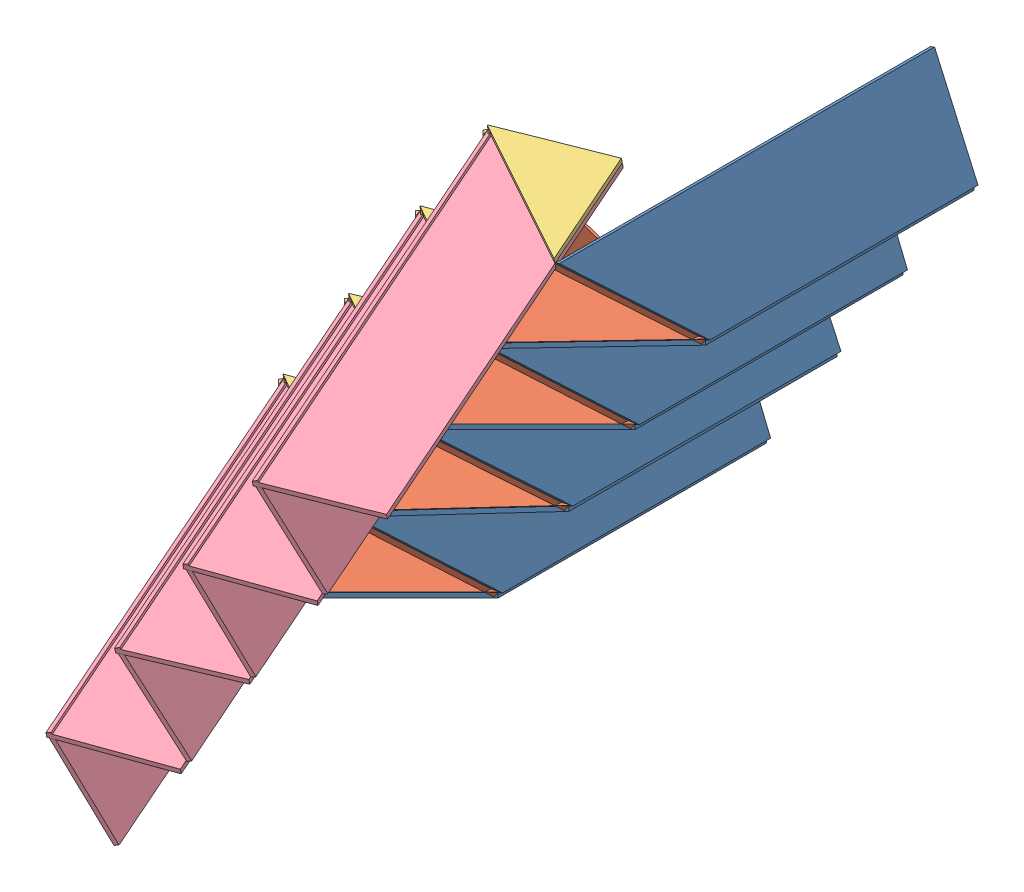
SolidWorks assembly full folded.SLDASM, configuration Default (file format 14000). Lengths in mm.
Overall size (96.64 115.9 141.02).
36 component instances, 4 part files, 6 mates.
Components (placement in the parent):
- Assemfolded-1: Assemfolded.SLDASM [Default] at (68.4019 -56.614 -139.3368) size (51.82 46.44 141.02)
  - Boss-Extrude2-1: Boss-Extrude2.SLDPRT [Default] at (6.7823 44.795 209.5172) size (23 1 80.5)
  - Boss-Extrude3-1: Boss-Extrude3.SLDPRT [Default] at (-77.2034 103.0562 125.5316) x (0.183258 0.547128 -0.816742) z (-0.816742 0.547128 0.183258) size (23 1 46)
  - Boss-Extrude5-1: Boss-Extrude5.SLDPRT [Default] at (-25.0941 66.1487 9.6695) x (-0.334135 0.893725 0.299349) z (-0.299349 0.200531 -0.932833) size (23 1 23)
  - Boss-Extrude6-1: Boss-Extrude6.SLDPRT [Default] at (24.8885 34.6658 159.4546) x (-0.334135 0.893725 0.299349) z (0.299349 -0.200531 0.932833) size (23 1 80.5)
  - Boss-Extrude2-2: Boss-Extrude2.SLDPRT [Default] at (21.0308 67.065 209.5172) x (0.380497 -0.924782 0) z (0 0 1) size (23 1 80.5)
  - Boss-Extrude3-2: Boss-Extrude3.SLDPRT [Default] at (-63.502 123.6928 124.9844) x (-0.436245 -0.377654 -0.816742) z (-0.816742 0.547128 0.183258) size (23 1 46)
  - Boss-Extrude5-2: Boss-Extrude5.SLDPRT [Default] at (-9.9518 87.82 9.469) x (-0.953638 -0.031057 0.299349) z (-0.299349 0.200531 -0.932833) size (23 1 23)
  - Boss-Extrude6-2: Boss-Extrude6.SLDPRT [Default] at (16.2786 53.841 166.3396) x (0.953638 0.031057 -0.299349) z (0.299349 -0.200531 0.932833) size (23 1 80.5)
- Assemfolded-2: Assemfolded.SLDASM [Default] at (85.5276 -34.2159 -139.3368) x (0.999056 0.043442 0) z (0 0 1) size (51.82 46.44 141.02)
  - Boss-Extrude2-1: Boss-Extrude2.SLDPRT [Default] at (6.7823 44.795 209.5172) size (23 1 80.5)
  - Boss-Extrude3-1: Boss-Extrude3.SLDPRT [Default] at (-77.2034 103.0562 125.5316) x (0.183258 0.547128 -0.816742) z (-0.816742 0.547128 0.183258) size (23 1 46)
  - Boss-Extrude5-1: Boss-Extrude5.SLDPRT [Default] at (-25.0941 66.1487 9.6695) x (-0.334135 0.893725 0.299349) z (-0.299349 0.200531 -0.932833) size (23 1 23)
  - Boss-Extrude6-1: Boss-Extrude6.SLDPRT [Default] at (24.8885 34.6658 159.4546) x (-0.334135 0.893725 0.299349) z (0.299349 -0.200531 0.932833) size (23 1 80.5)
  - Boss-Extrude2-2: Boss-Extrude2.SLDPRT [Default] at (21.0308 67.065 209.5172) x (0.380497 -0.924782 0) z (0 0 1) size (23 1 80.5)
  - Boss-Extrude3-2: Boss-Extrude3.SLDPRT [Default] at (-63.502 123.6928 124.9844) x (-0.436245 -0.377654 -0.816742) z (-0.816742 0.547128 0.183258) size (23 1 46)
  - Boss-Extrude5-2: Boss-Extrude5.SLDPRT [Default] at (-9.9518 87.82 9.469) x (-0.953638 -0.031057 0.299349) z (-0.299349 0.200531 -0.932833) size (23 1 23)
  - Boss-Extrude6-2: Boss-Extrude6.SLDPRT [Default] at (16.2786 53.841 166.3396) x (0.953638 0.031057 -0.299349) z (0.299349 -0.200531 0.932833) size (23 1 80.5)
- Assemfolded-3: Assemfolded.SLDASM [Default] at (97.7503 -10.6752 -139.3368) size (51.82 46.44 141.02)
  - Boss-Extrude2-1: Boss-Extrude2.SLDPRT [Default] at (6.7823 44.795 209.5172) size (23 1 80.5)
  - Boss-Extrude3-1: Boss-Extrude3.SLDPRT [Default] at (-77.2034 103.0562 125.5316) x (0.183258 0.547128 -0.816742) z (-0.816742 0.547128 0.183258) size (23 1 46)
  - Boss-Extrude5-1: Boss-Extrude5.SLDPRT [Default] at (-25.0941 66.1487 9.6695) x (-0.334135 0.893725 0.299349) z (-0.299349 0.200531 -0.932833) size (23 1 23)
  - Boss-Extrude6-1: Boss-Extrude6.SLDPRT [Default] at (24.8885 34.6658 159.4546) x (-0.334135 0.893725 0.299349) z (0.299349 -0.200531 0.932833) size (23 1 80.5)
  - Boss-Extrude2-2: Boss-Extrude2.SLDPRT [Default] at (21.0308 67.065 209.5172) x (0.380497 -0.924782 0) z (0 0 1) size (23 1 80.5)
  - Boss-Extrude3-2: Boss-Extrude3.SLDPRT [Default] at (-63.502 123.6928 124.9844) x (-0.436245 -0.377654 -0.816742) z (-0.816742 0.547128 0.183258) size (23 1 46)
  - Boss-Extrude5-2: Boss-Extrude5.SLDPRT [Default] at (-9.9518 87.82 9.469) x (-0.953638 -0.031057 0.299349) z (-0.299349 0.200531 -0.932833) size (23 1 23)
  - Boss-Extrude6-2: Boss-Extrude6.SLDPRT [Default] at (16.2786 53.841 166.3396) x (0.953638 0.031057 -0.299349) z (0.299349 -0.200531 0.932833) size (23 1 80.5)
- Assemfolded-4: Assemfolded.SLDASM [Default] at (114.1337 11.8087 -139.3368) x (0.999637 0.026959 0) z (0 0 1) size (51.82 46.44 141.02)
  - Boss-Extrude2-1: Boss-Extrude2.SLDPRT [Default] at (6.7823 44.795 209.5172) size (23 1 80.5)
  - Boss-Extrude3-1: Boss-Extrude3.SLDPRT [Default] at (-77.2034 103.0562 125.5316) x (0.183258 0.547128 -0.816742) z (-0.816742 0.547128 0.183258) size (23 1 46)
  - Boss-Extrude5-1: Boss-Extrude5.SLDPRT [Default] at (-25.0941 66.1487 9.6695) x (-0.334135 0.893725 0.299349) z (-0.299349 0.200531 -0.932833) size (23 1 23)
  - Boss-Extrude6-1: Boss-Extrude6.SLDPRT [Default] at (24.8885 34.6658 159.4546) x (-0.334135 0.893725 0.299349) z (0.299349 -0.200531 0.932833) size (23 1 80.5)
  - Boss-Extrude2-2: Boss-Extrude2.SLDPRT [Default] at (21.0308 67.065 209.5172) x (0.380497 -0.924782 0) z (0 0 1) size (23 1 80.5)
  - Boss-Extrude3-2: Boss-Extrude3.SLDPRT [Default] at (-63.502 123.6928 124.9844) x (-0.436245 -0.377654 -0.816742) z (-0.816742 0.547128 0.183258) size (23 1 46)
  - Boss-Extrude5-2: Boss-Extrude5.SLDPRT [Default] at (-9.9518 87.82 9.469) x (-0.953638 -0.031057 0.299349) z (-0.299349 0.200531 -0.932833) size (23 1 23)
  - Boss-Extrude6-2: Boss-Extrude6.SLDPRT [Default] at (16.2786 53.841 166.3396) x (0.953638 0.031057 -0.299349) z (0.299349 -0.200531 0.932833) size (23 1 80.5)
Mates (geometry in assembly coordinates):
- Coincident1: coincident aligned: line of Assemfolded-1/Boss-Extrude2-2 through (90.3575 10.8315 -33.3195) axis (0 0 -1); line of Assemfolded-2/Boss-Extrude2-1 through (90.3575 10.8315 -33.3195) axis (0 0 -1)
- Coincident2: coincident: point of Assemfolded-1/Boss-Extrude2-2; point of Assemfolded-2/Boss-Extrude2-1
- Coincident3: coincident aligned: line of Assemfolded-2/Boss-Extrude2-2 through (104.5325 34.1198 -33.3195) axis (0 0 -1); line of Assemfolded-3/Boss-Extrude2-1 through (104.5325 34.1198 -33.3195) axis (0 0 -1)
- Coincident4: coincident: point of Assemfolded-2/Boss-Extrude2-2; point of Assemfolded-3/Boss-Extrude2-1
- Coincident5: coincident aligned: line of Assemfolded-3/Boss-Extrude2-2 through (119.7059 56.7703 -33.3195) axis (0 0 -1); line of Assemfolded-4/Boss-Extrude2-1 through (119.7059 56.7703 -33.3195) axis (0 0 -1)
- Coincident6: coincident: point of Assemfolded-3/Boss-Extrude2-2; point of Assemfolded-4/Boss-Extrude2-1
